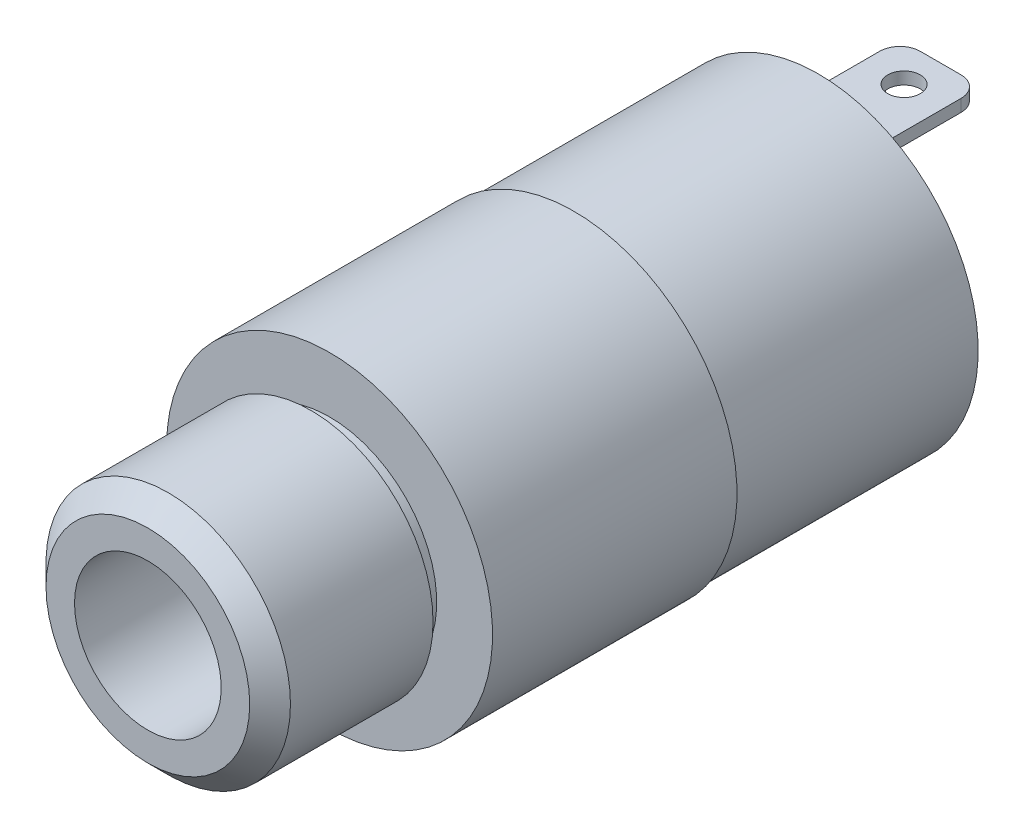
ISO-10303-21;
HEADER;
FILE_DESCRIPTION(('STEP AP214'),'2;1');
FILE_NAME('part.step','',(''),(''),'','','');
FILE_SCHEMA(('AUTOMOTIVE_DESIGN { 1 0 10303 214 1 1 1 1 }'));
ENDSEC;
DATA;
#1=APPLICATION_CONTEXT('core data for automotive mechanical design processes');
#2=APPLICATION_PROTOCOL_DEFINITION('international standard','automotive_design',2000,#1);
#3=PRODUCT_CONTEXT('',#1,'mechanical');
#4=PRODUCT('Part','Part','',(#3));
#5=PRODUCT_RELATED_PRODUCT_CATEGORY('part','',(#4));
#6=PRODUCT_DEFINITION_FORMATION('','',#4);
#7=PRODUCT_DEFINITION_CONTEXT('part definition',#1,'design');
#8=PRODUCT_DEFINITION('design','',#6,#7);
#9=PRODUCT_DEFINITION_SHAPE('','',#8);
#10=(LENGTH_UNIT() NAMED_UNIT(*) SI_UNIT(.MILLI.,.METRE.));
#11=(NAMED_UNIT(*) PLANE_ANGLE_UNIT() SI_UNIT($,.RADIAN.));
#12=(NAMED_UNIT(*) SI_UNIT($,.STERADIAN.) SOLID_ANGLE_UNIT());
#13=UNCERTAINTY_MEASURE_WITH_UNIT(LENGTH_MEASURE(1.E-05),#10,'distance_accuracy_value','');
#14=(GEOMETRIC_REPRESENTATION_CONTEXT(3) GLOBAL_UNCERTAINTY_ASSIGNED_CONTEXT((#13)) GLOBAL_UNIT_ASSIGNED_CONTEXT((#10,
#11,#12)) REPRESENTATION_CONTEXT('',''));
#15=CARTESIAN_POINT('',(0.,0.,0.));
#16=DIRECTION('',(0.,0.,1.));
#17=DIRECTION('',(1.,0.,0.));
#18=AXIS2_PLACEMENT_3D('',#15,#16,#17);
#19=CARTESIAN_POINT('',(0.,0.,-12.));
#20=DIRECTION('',(0.,0.,1.));
#21=DIRECTION('',(1.,0.,0.));
#22=AXIS2_PLACEMENT_3D('',#19,#20,#21);
#23=PLANE('',#22);
#24=CARTESIAN_POINT('',(0.,0.,-12.));
#25=DIRECTION('',(0.,0.,-1.));
#26=DIRECTION('',(-1.,0.,0.));
#27=AXIS2_PLACEMENT_3D('',#24,#25,#26);
#28=CIRCLE('',#27,1.775);
#29=CARTESIAN_POINT('',(-1.775,0.,-12.));
#30=VERTEX_POINT('',#29);
#31=EDGE_CURVE('E20',#30,#30,#28,.F.);
#32=ORIENTED_EDGE('',*,*,#31,.T.);
#33=EDGE_LOOP('',(#32));
#34=FACE_BOUND('',#33,.T.);
#35=ADVANCED_FACE('F17',(#34),#23,.T.);
#36=CARTESIAN_POINT('',(0.,0.,4.));
#37=DIRECTION('',(0.,0.,-1.));
#38=DIRECTION('',(-1.,0.,0.));
#39=AXIS2_PLACEMENT_3D('',#36,#37,#38);
#40=CYLINDRICAL_SURFACE('',#39,1.775);
#41=ORIENTED_EDGE('',*,*,#31,.F.);
#42=EDGE_LOOP('',(#41));
#43=FACE_BOUND('',#42,.T.);
#44=CARTESIAN_POINT('',(0.,0.,-6.46));
#45=DIRECTION('',(0.,0.,-1.));
#46=DIRECTION('',(-1.,0.,0.));
#47=AXIS2_PLACEMENT_3D('',#44,#45,#46);
#48=CIRCLE('',#47,1.775);
#49=CARTESIAN_POINT('',(-1.775,0.,-6.46));
#50=VERTEX_POINT('',#49);
#51=EDGE_CURVE('E179',#50,#50,#48,.T.);
#52=ORIENTED_EDGE('',*,*,#51,.F.);
#53=EDGE_LOOP('',(#52));
#54=FACE_BOUND('',#53,.T.);
#55=ADVANCED_FACE('F187',(#43,#54),#40,.F.);
#56=CARTESIAN_POINT('',(0.,0.,-6.46));
#57=DIRECTION('',(0.,0.,1.));
#58=DIRECTION('',(1.,0.,0.));
#59=AXIS2_PLACEMENT_3D('',#56,#57,#58);
#60=PLANE('',#59);
#61=CARTESIAN_POINT('',(0.,0.,-6.46));
#62=DIRECTION('',(0.,0.,-1.));
#63=DIRECTION('',(-1.,0.,0.));
#64=AXIS2_PLACEMENT_3D('',#61,#62,#63);
#65=CIRCLE('',#64,1.8);
#66=CARTESIAN_POINT('',(-1.8,0.,-6.46));
#67=VERTEX_POINT('',#66);
#68=EDGE_CURVE('E177',#67,#67,#65,.F.);
#69=ORIENTED_EDGE('',*,*,#68,.T.);
#70=EDGE_LOOP('',(#69));
#71=FACE_BOUND('',#70,.T.);
#72=ORIENTED_EDGE('',*,*,#51,.T.);
#73=EDGE_LOOP('',(#72));
#74=FACE_BOUND('',#73,.T.);
#75=ADVANCED_FACE('F190',(#71,#74),#60,.T.);
#76=CARTESIAN_POINT('',(0.,0.,4.));
#77=DIRECTION('',(0.,0.,-1.));
#78=DIRECTION('',(-1.,0.,0.));
#79=AXIS2_PLACEMENT_3D('',#76,#77,#78);
#80=CYLINDRICAL_SURFACE('',#79,1.8);
#81=ORIENTED_EDGE('',*,*,#68,.F.);
#82=EDGE_LOOP('',(#81));
#83=FACE_BOUND('',#82,.T.);
#84=CARTESIAN_POINT('',(0.,0.,4.));
#85=DIRECTION('',(0.,0.,-1.));
#86=DIRECTION('',(-1.,0.,0.));
#87=AXIS2_PLACEMENT_3D('',#84,#85,#86);
#88=CIRCLE('',#87,1.8);
#89=CARTESIAN_POINT('',(-1.8,0.,4.));
#90=VERTEX_POINT('',#89);
#91=EDGE_CURVE('E173',#90,#90,#88,.T.);
#92=ORIENTED_EDGE('',*,*,#91,.F.);
#93=EDGE_LOOP('',(#92));
#94=FACE_BOUND('',#93,.T.);
#95=ADVANCED_FACE('F196',(#83,#94),#80,.F.);
#96=CARTESIAN_POINT('',(0.,0.,4.));
#97=DIRECTION('',(0.,0.,1.));
#98=DIRECTION('',(1.,0.,0.));
#99=AXIS2_PLACEMENT_3D('',#96,#97,#98);
#100=PLANE('',#99);
#101=CARTESIAN_POINT('',(0.,0.,4.0000000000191));
#102=DIRECTION('',(0.,0.,-1.));
#103=DIRECTION('',(0.,1.,0.));
#104=AXIS2_PLACEMENT_3D('',#101,#102,#103);
#105=CIRCLE('',#104,2.49999999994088);
#106=CARTESIAN_POINT('',(0.,2.49999999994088,4.0000000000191));
#107=VERTEX_POINT('',#106);
#108=EDGE_CURVE('E164',#107,#107,#105,.T.);
#109=ORIENTED_EDGE('',*,*,#108,.F.);
#110=EDGE_LOOP('',(#109));
#111=FACE_BOUND('',#110,.T.);
#112=ORIENTED_EDGE('',*,*,#91,.T.);
#113=EDGE_LOOP('',(#112));
#114=FACE_BOUND('',#113,.T.);
#115=ADVANCED_FACE('F329',(#111,#114),#100,.T.);
#116=CARTESIAN_POINT('',(0.,-2.65,-14.56));
#117=DIRECTION('',(0.,1.,0.));
#118=DIRECTION('',(0.,0.,1.));
#119=AXIS2_PLACEMENT_3D('',#116,#117,#118);
#120=CYLINDRICAL_SURFACE('',#119,0.4);
#121=CARTESIAN_POINT('',(0.,-2.65,-14.56));
#122=DIRECTION('',(0.,1.,0.));
#123=DIRECTION('',(0.,0.,1.));
#124=AXIS2_PLACEMENT_3D('',#121,#122,#123);
#125=CIRCLE('',#124,0.4);
#126=CARTESIAN_POINT('',(0.,-2.65,-14.16));
#127=VERTEX_POINT('',#126);
#128=EDGE_CURVE('E757',#127,#127,#125,.T.);
#129=ORIENTED_EDGE('',*,*,#128,.F.);
#130=EDGE_LOOP('',(#129));
#131=FACE_BOUND('',#130,.T.);
#132=CARTESIAN_POINT('',(0.,-2.35,-14.56));
#133=DIRECTION('',(0.,1.,0.));
#134=DIRECTION('',(0.,0.,1.));
#135=AXIS2_PLACEMENT_3D('',#132,#133,#134);
#136=CIRCLE('',#135,0.4);
#137=CARTESIAN_POINT('',(0.,-2.35,-14.16));
#138=VERTEX_POINT('',#137);
#139=EDGE_CURVE('E880',#138,#138,#136,.F.);
#140=ORIENTED_EDGE('',*,*,#139,.F.);
#141=EDGE_LOOP('',(#140));
#142=FACE_BOUND('',#141,.T.);
#143=ADVANCED_FACE('F326',(#131,#142),#120,.F.);
#144=CARTESIAN_POINT('',(0.499999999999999,-2.425,-14.96));
#145=DIRECTION('',(0.,-1.,0.));
#146=DIRECTION('',(0.,0.,-1.));
#147=AXIS2_PLACEMENT_3D('',#144,#145,#146);
#148=CYLINDRICAL_SURFACE('',#147,0.5);
#149=CARTESIAN_POINT('',(0.499999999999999,-2.35,-14.96));
#150=DIRECTION('',(0.,-1.,0.));
#151=DIRECTION('',(0.,0.,-1.));
#152=AXIS2_PLACEMENT_3D('',#149,#150,#151);
#153=CIRCLE('',#152,0.5);
#154=CARTESIAN_POINT('',(0.999999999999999,-2.35,-14.96));
#155=VERTEX_POINT('',#154);
#156=CARTESIAN_POINT('',(0.499999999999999,-2.35,-15.46));
#157=VERTEX_POINT('',#156);
#158=EDGE_CURVE('E144',#155,#157,#153,.F.);
#159=ORIENTED_EDGE('',*,*,#158,.F.);
#160=DIRECTION('',(0.,1.,0.));
#161=VECTOR('',#160,1.);
#162=CARTESIAN_POINT('',(0.999999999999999,-2.35,-14.96));
#163=LINE('',#162,#161);
#164=CARTESIAN_POINT('',(0.999999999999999,-2.65,-14.96));
#165=VERTEX_POINT('',#164);
#166=EDGE_CURVE('E140',#165,#155,#163,.T.);
#167=ORIENTED_EDGE('',*,*,#166,.F.);
#168=CARTESIAN_POINT('',(0.499999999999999,-2.65,-14.96));
#169=DIRECTION('',(0.,-1.,0.));
#170=DIRECTION('',(0.,0.,-1.));
#171=AXIS2_PLACEMENT_3D('',#168,#169,#170);
#172=CIRCLE('',#171,0.5);
#173=CARTESIAN_POINT('',(0.499999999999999,-2.65,-15.46));
#174=VERTEX_POINT('',#173);
#175=EDGE_CURVE('E137',#174,#165,#172,.T.);
#176=ORIENTED_EDGE('',*,*,#175,.F.);
#177=DIRECTION('',(0.,1.,0.));
#178=VECTOR('',#177,1.);
#179=CARTESIAN_POINT('',(0.499999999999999,-2.5,-15.46));
#180=LINE('',#179,#178);
#181=EDGE_CURVE('E176',#174,#157,#180,.T.);
#182=ORIENTED_EDGE('',*,*,#181,.T.);
#183=EDGE_LOOP('',(#159,#167,#176,#182));
#184=FACE_BOUND('',#183,.T.);
#185=ADVANCED_FACE('F142',(#184),#148,.T.);
#186=CARTESIAN_POINT('',(0.,-2.5,-15.46));
#187=DIRECTION('',(0.,0.,1.));
#188=DIRECTION('',(1.,0.,0.));
#189=AXIS2_PLACEMENT_3D('',#186,#187,#188);
#190=PLANE('',#189);
#191=DIRECTION('',(1.,0.,0.));
#192=VECTOR('',#191,1.);
#193=CARTESIAN_POINT('',(0.999999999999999,-2.65,-15.46));
#194=LINE('',#193,#192);
#195=CARTESIAN_POINT('',(-0.500000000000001,-2.65,-15.46));
#196=VERTEX_POINT('',#195);
#197=EDGE_CURVE('E163',#196,#174,#194,.T.);
#198=ORIENTED_EDGE('',*,*,#197,.F.);
#199=DIRECTION('',(0.,1.,0.));
#200=VECTOR('',#199,1.);
#201=CARTESIAN_POINT('',(-0.500000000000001,-2.575,-15.46));
#202=LINE('',#201,#200);
#203=CARTESIAN_POINT('',(-0.500000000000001,-2.35,-15.46));
#204=VERTEX_POINT('',#203);
#205=EDGE_CURVE('E827',#204,#196,#202,.F.);
#206=ORIENTED_EDGE('',*,*,#205,.F.);
#207=DIRECTION('',(-1.,0.,0.));
#208=VECTOR('',#207,1.);
#209=CARTESIAN_POINT('',(-1.,-2.35,-15.46));
#210=LINE('',#209,#208);
#211=EDGE_CURVE('E753',#157,#204,#210,.T.);
#212=ORIENTED_EDGE('',*,*,#211,.F.);
#213=ORIENTED_EDGE('',*,*,#181,.F.);
#214=EDGE_LOOP('',(#198,#206,#212,#213));
#215=FACE_BOUND('',#214,.T.);
#216=ADVANCED_FACE('F319',(#215),#190,.F.);
#217=CARTESIAN_POINT('',(-0.500000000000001,-2.575,-14.96));
#218=DIRECTION('',(0.,1.,0.));
#219=DIRECTION('',(0.,0.,1.));
#220=AXIS2_PLACEMENT_3D('',#217,#218,#219);
#221=CYLINDRICAL_SURFACE('',#220,0.5);
#222=CARTESIAN_POINT('',(-0.500000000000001,-2.65,-14.96));
#223=DIRECTION('',(0.,1.,0.));
#224=DIRECTION('',(0.,0.,1.));
#225=AXIS2_PLACEMENT_3D('',#222,#223,#224);
#226=CIRCLE('',#225,0.5);
#227=CARTESIAN_POINT('',(-1.,-2.65,-14.96));
#228=VERTEX_POINT('',#227);
#229=EDGE_CURVE('E170',#228,#196,#226,.F.);
#230=ORIENTED_EDGE('',*,*,#229,.F.);
#231=DIRECTION('',(0.,1.,0.));
#232=VECTOR('',#231,1.);
#233=CARTESIAN_POINT('',(-1.,-2.65,-14.96));
#234=LINE('',#233,#232);
#235=CARTESIAN_POINT('',(-1.,-2.35,-14.96));
#236=VERTEX_POINT('',#235);
#237=EDGE_CURVE('E825',#236,#228,#234,.F.);
#238=ORIENTED_EDGE('',*,*,#237,.F.);
#239=CARTESIAN_POINT('',(-0.500000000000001,-2.35,-14.96));
#240=DIRECTION('',(0.,1.,0.));
#241=DIRECTION('',(0.,0.,1.));
#242=AXIS2_PLACEMENT_3D('',#239,#240,#241);
#243=CIRCLE('',#242,0.5);
#244=EDGE_CURVE('E750',#204,#236,#243,.T.);
#245=ORIENTED_EDGE('',*,*,#244,.F.);
#246=ORIENTED_EDGE('',*,*,#205,.T.);
#247=EDGE_LOOP('',(#230,#238,#245,#246));
#248=FACE_BOUND('',#247,.T.);
#249=ADVANCED_FACE('F315',(#248),#221,.T.);
#250=CARTESIAN_POINT('',(-1.,-2.65,-12.46));
#251=DIRECTION('',(-1.,0.,0.));
#252=DIRECTION('',(0.,0.,1.));
#253=AXIS2_PLACEMENT_3D('',#250,#251,#252);
#254=PLANE('',#253);
#255=DIRECTION('',(0.,1.,0.));
#256=VECTOR('',#255,1.);
#257=CARTESIAN_POINT('',(-1.,-2.65,-12.46));
#258=LINE('',#257,#256);
#259=CARTESIAN_POINT('',(-1.,-2.65,-12.46));
#260=VERTEX_POINT('',#259);
#261=CARTESIAN_POINT('',(-1.,-2.35,-12.46));
#262=VERTEX_POINT('',#261);
#263=EDGE_CURVE('E149',#260,#262,#258,.T.);
#264=ORIENTED_EDGE('',*,*,#263,.T.);
#265=DIRECTION('',(0.,0.,1.));
#266=VECTOR('',#265,1.);
#267=CARTESIAN_POINT('',(-1.,-2.35,-12.46));
#268=LINE('',#267,#266);
#269=EDGE_CURVE('E745',#236,#262,#268,.T.);
#270=ORIENTED_EDGE('',*,*,#269,.F.);
#271=ORIENTED_EDGE('',*,*,#237,.T.);
#272=DIRECTION('',(0.,0.,-1.));
#273=VECTOR('',#272,1.);
#274=CARTESIAN_POINT('',(-1.,-2.65,-12.46));
#275=LINE('',#274,#273);
#276=EDGE_CURVE('E157',#260,#228,#275,.T.);
#277=ORIENTED_EDGE('',*,*,#276,.F.);
#278=EDGE_LOOP('',(#264,#270,#271,#277));
#279=FACE_BOUND('',#278,.T.);
#280=ADVANCED_FACE('F312',(#279),#254,.T.);
#281=CARTESIAN_POINT('',(0.999999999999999,-2.35,-12.46));
#282=DIRECTION('',(1.,0.,0.));
#283=DIRECTION('',(0.,0.,-1.));
#284=AXIS2_PLACEMENT_3D('',#281,#282,#283);
#285=PLANE('',#284);
#286=DIRECTION('',(0.,1.,0.));
#287=VECTOR('',#286,1.);
#288=CARTESIAN_POINT('',(0.999999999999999,-2.35,-12.46));
#289=LINE('',#288,#287);
#290=CARTESIAN_POINT('',(0.999999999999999,-2.35,-12.46));
#291=VERTEX_POINT('',#290);
#292=CARTESIAN_POINT('',(0.999999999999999,-2.65,-12.46));
#293=VERTEX_POINT('',#292);
#294=EDGE_CURVE('E148',#291,#293,#289,.F.);
#295=ORIENTED_EDGE('',*,*,#294,.T.);
#296=DIRECTION('',(0.,0.,-1.));
#297=VECTOR('',#296,1.);
#298=CARTESIAN_POINT('',(0.999999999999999,-2.65,-12.46));
#299=LINE('',#298,#297);
#300=EDGE_CURVE('E152',#165,#293,#299,.F.);
#301=ORIENTED_EDGE('',*,*,#300,.F.);
#302=ORIENTED_EDGE('',*,*,#166,.T.);
#303=DIRECTION('',(0.,0.,1.));
#304=VECTOR('',#303,1.);
#305=CARTESIAN_POINT('',(0.999999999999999,-2.35,-12.46));
#306=LINE('',#305,#304);
#307=EDGE_CURVE('E743',#291,#155,#306,.F.);
#308=ORIENTED_EDGE('',*,*,#307,.F.);
#309=EDGE_LOOP('',(#295,#301,#302,#308));
#310=FACE_BOUND('',#309,.T.);
#311=ADVANCED_FACE('F153',(#310),#285,.T.);
#312=CARTESIAN_POINT('',(0.,-2.65,-14.56));
#313=DIRECTION('',(0.,1.,0.));
#314=DIRECTION('',(0.,0.,1.));
#315=AXIS2_PLACEMENT_3D('',#312,#313,#314);
#316=CYLINDRICAL_SURFACE('',#315,0.4);
#317=CARTESIAN_POINT('',(0.,2.35,-14.56));
#318=DIRECTION('',(0.,1.,0.));
#319=DIRECTION('',(0.,0.,1.));
#320=AXIS2_PLACEMENT_3D('',#317,#318,#319);
#321=CIRCLE('',#320,0.4);
#322=CARTESIAN_POINT('',(0.,2.35,-14.16));
#323=VERTEX_POINT('',#322);
#324=EDGE_CURVE('E868',#323,#323,#321,.T.);
#325=ORIENTED_EDGE('',*,*,#324,.F.);
#326=EDGE_LOOP('',(#325));
#327=FACE_BOUND('',#326,.T.);
#328=CARTESIAN_POINT('',(0.,2.65,-14.56));
#329=DIRECTION('',(0.,1.,0.));
#330=DIRECTION('',(0.,0.,1.));
#331=AXIS2_PLACEMENT_3D('',#328,#329,#330);
#332=CIRCLE('',#331,0.4);
#333=CARTESIAN_POINT('',(0.,2.65,-14.16));
#334=VERTEX_POINT('',#333);
#335=EDGE_CURVE('E730',#334,#334,#332,.F.);
#336=ORIENTED_EDGE('',*,*,#335,.F.);
#337=EDGE_LOOP('',(#336));
#338=FACE_BOUND('',#337,.T.);
#339=ADVANCED_FACE('F305',(#327,#338),#316,.F.);
#340=CARTESIAN_POINT('',(-0.5,2.425,-14.96));
#341=DIRECTION('',(0.,1.,0.));
#342=DIRECTION('',(0.,0.,1.));
#343=AXIS2_PLACEMENT_3D('',#340,#341,#342);
#344=CYLINDRICAL_SURFACE('',#343,0.5);
#345=CARTESIAN_POINT('',(-0.5,2.35,-14.96));
#346=DIRECTION('',(0.,1.,0.));
#347=DIRECTION('',(0.,0.,1.));
#348=AXIS2_PLACEMENT_3D('',#345,#346,#347);
#349=CIRCLE('',#348,0.5);
#350=CARTESIAN_POINT('',(-1.,2.35,-14.96));
#351=VERTEX_POINT('',#350);
#352=CARTESIAN_POINT('',(-0.5,2.35,-15.46));
#353=VERTEX_POINT('',#352);
#354=EDGE_CURVE('E726',#351,#353,#349,.F.);
#355=ORIENTED_EDGE('',*,*,#354,.F.);
#356=DIRECTION('',(0.,1.,0.));
#357=VECTOR('',#356,1.);
#358=CARTESIAN_POINT('',(-1.,2.35,-14.96));
#359=LINE('',#358,#357);
#360=CARTESIAN_POINT('',(-1.,2.65,-14.96));
#361=VERTEX_POINT('',#360);
#362=EDGE_CURVE('E793',#361,#351,#359,.F.);
#363=ORIENTED_EDGE('',*,*,#362,.F.);
#364=CARTESIAN_POINT('',(-0.5,2.65,-14.96));
#365=DIRECTION('',(0.,1.,0.));
#366=DIRECTION('',(0.,0.,1.));
#367=AXIS2_PLACEMENT_3D('',#364,#365,#366);
#368=CIRCLE('',#367,0.5);
#369=CARTESIAN_POINT('',(-0.5,2.65,-15.46));
#370=VERTEX_POINT('',#369);
#371=EDGE_CURVE('E740',#370,#361,#368,.T.);
#372=ORIENTED_EDGE('',*,*,#371,.F.);
#373=DIRECTION('',(0.,1.,0.));
#374=VECTOR('',#373,1.);
#375=CARTESIAN_POINT('',(-0.5,2.5,-15.46));
#376=LINE('',#375,#374);
#377=EDGE_CURVE('E812',#370,#353,#376,.F.);
#378=ORIENTED_EDGE('',*,*,#377,.T.);
#379=EDGE_LOOP('',(#355,#363,#372,#378));
#380=FACE_BOUND('',#379,.T.);
#381=ADVANCED_FACE('F301',(#380),#344,.T.);
#382=CARTESIAN_POINT('',(0.,2.5,-15.46));
#383=DIRECTION('',(0.,0.,1.));
#384=DIRECTION('',(1.,0.,0.));
#385=AXIS2_PLACEMENT_3D('',#382,#383,#384);
#386=PLANE('',#385);
#387=DIRECTION('',(1.,0.,0.));
#388=VECTOR('',#387,1.);
#389=CARTESIAN_POINT('',(-1.,2.65,-15.46));
#390=LINE('',#389,#388);
#391=CARTESIAN_POINT('',(0.5,2.65,-15.46));
#392=VERTEX_POINT('',#391);
#393=EDGE_CURVE('E727',#392,#370,#390,.F.);
#394=ORIENTED_EDGE('',*,*,#393,.F.);
#395=DIRECTION('',(0.,-1.,0.));
#396=VECTOR('',#395,1.);
#397=CARTESIAN_POINT('',(0.5,2.575,-15.46));
#398=LINE('',#397,#396);
#399=CARTESIAN_POINT('',(0.5,2.35,-15.46));
#400=VERTEX_POINT('',#399);
#401=EDGE_CURVE('E807',#400,#392,#398,.F.);
#402=ORIENTED_EDGE('',*,*,#401,.F.);
#403=DIRECTION('',(1.,0.,0.));
#404=VECTOR('',#403,1.);
#405=CARTESIAN_POINT('',(1.,2.35,-15.46));
#406=LINE('',#405,#404);
#407=EDGE_CURVE('E723',#353,#400,#406,.T.);
#408=ORIENTED_EDGE('',*,*,#407,.F.);
#409=ORIENTED_EDGE('',*,*,#377,.F.);
#410=EDGE_LOOP('',(#394,#402,#408,#409));
#411=FACE_BOUND('',#410,.T.);
#412=ADVANCED_FACE('F297',(#411),#386,.F.);
#413=CARTESIAN_POINT('',(0.5,2.575,-14.96));
#414=DIRECTION('',(0.,-1.,0.));
#415=DIRECTION('',(1.,0.,0.));
#416=AXIS2_PLACEMENT_3D('',#413,#414,#415);
#417=CYLINDRICAL_SURFACE('',#416,0.5);
#418=CARTESIAN_POINT('',(0.5,2.65,-14.96));
#419=DIRECTION('',(0.,-1.,0.));
#420=DIRECTION('',(1.,0.,0.));
#421=AXIS2_PLACEMENT_3D('',#418,#419,#420);
#422=CIRCLE('',#421,0.5);
#423=CARTESIAN_POINT('',(1.,2.65,-14.96));
#424=VERTEX_POINT('',#423);
#425=EDGE_CURVE('E731',#424,#392,#422,.F.);
#426=ORIENTED_EDGE('',*,*,#425,.F.);
#427=DIRECTION('',(0.,1.,0.));
#428=VECTOR('',#427,1.);
#429=CARTESIAN_POINT('',(1.,2.65,-14.96));
#430=LINE('',#429,#428);
#431=CARTESIAN_POINT('',(1.,2.35,-14.96));
#432=VERTEX_POINT('',#431);
#433=EDGE_CURVE('E805',#432,#424,#430,.T.);
#434=ORIENTED_EDGE('',*,*,#433,.F.);
#435=CARTESIAN_POINT('',(0.5,2.35,-14.96));
#436=DIRECTION('',(0.,-1.,0.));
#437=DIRECTION('',(1.,0.,0.));
#438=AXIS2_PLACEMENT_3D('',#435,#436,#437);
#439=CIRCLE('',#438,0.5);
#440=EDGE_CURVE('E720',#400,#432,#439,.T.);
#441=ORIENTED_EDGE('',*,*,#440,.F.);
#442=ORIENTED_EDGE('',*,*,#401,.T.);
#443=EDGE_LOOP('',(#426,#434,#441,#442));
#444=FACE_BOUND('',#443,.T.);
#445=ADVANCED_FACE('F293',(#444),#417,.T.);
#446=CARTESIAN_POINT('',(1.,2.65,-12.46));
#447=DIRECTION('',(1.,0.,0.));
#448=DIRECTION('',(0.,1.,0.));
#449=AXIS2_PLACEMENT_3D('',#446,#447,#448);
#450=PLANE('',#449);
#451=DIRECTION('',(0.,1.,0.));
#452=VECTOR('',#451,1.);
#453=CARTESIAN_POINT('',(1.,2.65,-12.46));
#454=LINE('',#453,#452);
#455=CARTESIAN_POINT('',(1.,2.65,-12.46));
#456=VERTEX_POINT('',#455);
#457=CARTESIAN_POINT('',(1.,2.35,-12.46));
#458=VERTEX_POINT('',#457);
#459=EDGE_CURVE('E796',#456,#458,#454,.F.);
#460=ORIENTED_EDGE('',*,*,#459,.T.);
#461=DIRECTION('',(0.,0.,-1.));
#462=VECTOR('',#461,1.);
#463=CARTESIAN_POINT('',(1.,2.35,-12.46));
#464=LINE('',#463,#462);
#465=EDGE_CURVE('E715',#432,#458,#464,.F.);
#466=ORIENTED_EDGE('',*,*,#465,.F.);
#467=ORIENTED_EDGE('',*,*,#433,.T.);
#468=DIRECTION('',(0.,0.,1.));
#469=VECTOR('',#468,1.);
#470=CARTESIAN_POINT('',(1.,2.65,-12.46));
#471=LINE('',#470,#469);
#472=EDGE_CURVE('E732',#456,#424,#471,.F.);
#473=ORIENTED_EDGE('',*,*,#472,.F.);
#474=EDGE_LOOP('',(#460,#466,#467,#473));
#475=FACE_BOUND('',#474,.T.);
#476=ADVANCED_FACE('F289',(#475),#450,.T.);
#477=CARTESIAN_POINT('',(-1.,2.35,-12.46));
#478=DIRECTION('',(-1.,0.,0.));
#479=DIRECTION('',(0.,0.,1.));
#480=AXIS2_PLACEMENT_3D('',#477,#478,#479);
#481=PLANE('',#480);
#482=DIRECTION('',(0.,1.,0.));
#483=VECTOR('',#482,1.);
#484=CARTESIAN_POINT('',(-1.,2.35,-12.46));
#485=LINE('',#484,#483);
#486=CARTESIAN_POINT('',(-1.,2.35,-12.46));
#487=VERTEX_POINT('',#486);
#488=CARTESIAN_POINT('',(-1.,2.65,-12.46));
#489=VERTEX_POINT('',#488);
#490=EDGE_CURVE('E784',#487,#489,#485,.T.);
#491=ORIENTED_EDGE('',*,*,#490,.T.);
#492=DIRECTION('',(0.,0.,1.));
#493=VECTOR('',#492,1.);
#494=CARTESIAN_POINT('',(-1.,2.65,-12.46));
#495=LINE('',#494,#493);
#496=EDGE_CURVE('E735',#361,#489,#495,.T.);
#497=ORIENTED_EDGE('',*,*,#496,.F.);
#498=ORIENTED_EDGE('',*,*,#362,.T.);
#499=DIRECTION('',(0.,0.,-1.));
#500=VECTOR('',#499,1.);
#501=CARTESIAN_POINT('',(-1.,2.35,-12.46));
#502=LINE('',#501,#500);
#503=EDGE_CURVE('E712',#487,#351,#502,.T.);
#504=ORIENTED_EDGE('',*,*,#503,.F.);
#505=EDGE_LOOP('',(#491,#497,#498,#504));
#506=FACE_BOUND('',#505,.T.);
#507=ADVANCED_FACE('F285',(#506),#481,.T.);
#508=CARTESIAN_POINT('',(-2.65,0.,-15.21));
#509=DIRECTION('',(1.,0.,0.));
#510=DIRECTION('',(0.,1.,0.));
#511=AXIS2_PLACEMENT_3D('',#508,#509,#510);
#512=CYLINDRICAL_SURFACE('',#511,0.4);
#513=CARTESIAN_POINT('',(-2.65,0.,-15.21));
#514=DIRECTION('',(1.,0.,0.));
#515=DIRECTION('',(0.,1.,0.));
#516=AXIS2_PLACEMENT_3D('',#513,#514,#515);
#517=CIRCLE('',#516,0.4);
#518=CARTESIAN_POINT('',(-2.65,0.399999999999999,-15.21));
#519=VERTEX_POINT('',#518);
#520=EDGE_CURVE('E855',#519,#519,#517,.T.);
#521=ORIENTED_EDGE('',*,*,#520,.F.);
#522=EDGE_LOOP('',(#521));
#523=FACE_BOUND('',#522,.T.);
#524=CARTESIAN_POINT('',(-2.35,0.,-15.21));
#525=DIRECTION('',(1.,0.,0.));
#526=DIRECTION('',(0.,1.,0.));
#527=AXIS2_PLACEMENT_3D('',#524,#525,#526);
#528=CIRCLE('',#527,0.4);
#529=CARTESIAN_POINT('',(-2.35,0.399999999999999,-15.21));
#530=VERTEX_POINT('',#529);
#531=EDGE_CURVE('E699',#530,#530,#528,.F.);
#532=ORIENTED_EDGE('',*,*,#531,.F.);
#533=EDGE_LOOP('',(#532));
#534=FACE_BOUND('',#533,.T.);
#535=ADVANCED_FACE('F281',(#523,#534),#512,.F.);
#536=CARTESIAN_POINT('',(-2.425,-0.500000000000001,-15.96));
#537=DIRECTION('',(-1.,0.,0.));
#538=DIRECTION('',(0.,0.,1.));
#539=AXIS2_PLACEMENT_3D('',#536,#537,#538);
#540=CYLINDRICAL_SURFACE('',#539,0.5);
#541=CARTESIAN_POINT('',(-2.35,-0.500000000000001,-15.96));
#542=DIRECTION('',(-1.,0.,0.));
#543=DIRECTION('',(0.,0.,1.));
#544=AXIS2_PLACEMENT_3D('',#541,#542,#543);
#545=CIRCLE('',#544,0.5);
#546=CARTESIAN_POINT('',(-2.35,-1.,-15.96));
#547=VERTEX_POINT('',#546);
#548=CARTESIAN_POINT('',(-2.35,-0.500000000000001,-16.46));
#549=VERTEX_POINT('',#548);
#550=EDGE_CURVE('E711',#547,#549,#545,.F.);
#551=ORIENTED_EDGE('',*,*,#550,.F.);
#552=DIRECTION('',(1.,0.,0.));
#553=VECTOR('',#552,1.);
#554=CARTESIAN_POINT('',(-2.35,-1.,-15.96));
#555=LINE('',#554,#553);
#556=CARTESIAN_POINT('',(-2.65,-1.,-15.96));
#557=VERTEX_POINT('',#556);
#558=EDGE_CURVE('E781',#557,#547,#555,.T.);
#559=ORIENTED_EDGE('',*,*,#558,.F.);
#560=CARTESIAN_POINT('',(-2.65,-0.500000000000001,-15.96));
#561=DIRECTION('',(-1.,0.,0.));
#562=DIRECTION('',(0.,0.,1.));
#563=AXIS2_PLACEMENT_3D('',#560,#561,#562);
#564=CIRCLE('',#563,0.5);
#565=CARTESIAN_POINT('',(-2.65,-0.500000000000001,-16.46));
#566=VERTEX_POINT('',#565);
#567=EDGE_CURVE('E693',#566,#557,#564,.T.);
#568=ORIENTED_EDGE('',*,*,#567,.F.);
#569=DIRECTION('',(1.,0.,0.));
#570=VECTOR('',#569,1.);
#571=CARTESIAN_POINT('',(-2.5,-0.500000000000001,-16.46));
#572=LINE('',#571,#570);
#573=EDGE_CURVE('E167',#566,#549,#572,.T.);
#574=ORIENTED_EDGE('',*,*,#573,.T.);
#575=EDGE_LOOP('',(#551,#559,#568,#574));
#576=FACE_BOUND('',#575,.T.);
#577=ADVANCED_FACE('F278',(#576),#540,.T.);
#578=CARTESIAN_POINT('',(-2.35,-1.,-12.46));
#579=DIRECTION('',(0.,-1.,0.));
#580=DIRECTION('',(0.,0.,-1.));
#581=AXIS2_PLACEMENT_3D('',#578,#579,#580);
#582=PLANE('',#581);
#583=DIRECTION('',(1.,0.,0.));
#584=VECTOR('',#583,1.);
#585=CARTESIAN_POINT('',(-2.35,-1.,-12.46));
#586=LINE('',#585,#584);
#587=CARTESIAN_POINT('',(-2.35,-1.,-12.46));
#588=VERTEX_POINT('',#587);
#589=CARTESIAN_POINT('',(-2.65,-1.,-12.46));
#590=VERTEX_POINT('',#589);
#591=EDGE_CURVE('E35',#588,#590,#586,.F.);
#592=ORIENTED_EDGE('',*,*,#591,.T.);
#593=DIRECTION('',(0.,0.,1.));
#594=VECTOR('',#593,1.);
#595=CARTESIAN_POINT('',(-2.65,-1.,-12.46));
#596=LINE('',#595,#594);
#597=EDGE_CURVE('E689',#557,#590,#596,.T.);
#598=ORIENTED_EDGE('',*,*,#597,.F.);
#599=ORIENTED_EDGE('',*,*,#558,.T.);
#600=DIRECTION('',(0.,0.,1.));
#601=VECTOR('',#600,1.);
#602=CARTESIAN_POINT('',(-2.35,-1.,-12.46));
#603=LINE('',#602,#601);
#604=EDGE_CURVE('E696',#588,#547,#603,.F.);
#605=ORIENTED_EDGE('',*,*,#604,.F.);
#606=EDGE_LOOP('',(#592,#598,#599,#605));
#607=FACE_BOUND('',#606,.T.);
#608=ADVANCED_FACE('F274',(#607),#582,.T.);
#609=CARTESIAN_POINT('',(-2.65,0.999999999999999,-12.46));
#610=DIRECTION('',(0.,1.,0.));
#611=DIRECTION('',(0.,0.,1.));
#612=AXIS2_PLACEMENT_3D('',#609,#610,#611);
#613=PLANE('',#612);
#614=DIRECTION('',(1.,0.,0.));
#615=VECTOR('',#614,1.);
#616=CARTESIAN_POINT('',(-2.65,0.999999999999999,-12.46));
#617=LINE('',#616,#615);
#618=CARTESIAN_POINT('',(-2.65,0.999999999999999,-12.46));
#619=VERTEX_POINT('',#618);
#620=CARTESIAN_POINT('',(-2.35,0.999999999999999,-12.46));
#621=VERTEX_POINT('',#620);
#622=EDGE_CURVE('E769',#619,#621,#617,.T.);
#623=ORIENTED_EDGE('',*,*,#622,.T.);
#624=DIRECTION('',(0.,0.,1.));
#625=VECTOR('',#624,1.);
#626=CARTESIAN_POINT('',(-2.35,0.999999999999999,-12.46));
#627=LINE('',#626,#625);
#628=CARTESIAN_POINT('',(-2.35,0.999999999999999,-15.96));
#629=VERTEX_POINT('',#628);
#630=EDGE_CURVE('E700',#629,#621,#627,.T.);
#631=ORIENTED_EDGE('',*,*,#630,.F.);
#632=DIRECTION('',(1.,0.,0.));
#633=VECTOR('',#632,1.);
#634=CARTESIAN_POINT('',(-2.575,0.999999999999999,-15.96));
#635=LINE('',#634,#633);
#636=CARTESIAN_POINT('',(-2.65,0.999999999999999,-15.96));
#637=VERTEX_POINT('',#636);
#638=EDGE_CURVE('E766',#637,#629,#635,.T.);
#639=ORIENTED_EDGE('',*,*,#638,.F.);
#640=DIRECTION('',(0.,0.,1.));
#641=VECTOR('',#640,1.);
#642=CARTESIAN_POINT('',(-2.65,0.999999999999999,-12.46));
#643=LINE('',#642,#641);
#644=EDGE_CURVE('E686',#619,#637,#643,.F.);
#645=ORIENTED_EDGE('',*,*,#644,.F.);
#646=EDGE_LOOP('',(#623,#631,#639,#645));
#647=FACE_BOUND('',#646,.T.);
#648=ADVANCED_FACE('F270',(#647),#613,.T.);
#649=CARTESIAN_POINT('',(-2.575,0.499999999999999,-15.96));
#650=DIRECTION('',(1.,0.,0.));
#651=DIRECTION('',(0.,0.,-1.));
#652=AXIS2_PLACEMENT_3D('',#649,#650,#651);
#653=CYLINDRICAL_SURFACE('',#652,0.5);
#654=CARTESIAN_POINT('',(-2.65,0.499999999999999,-15.96));
#655=DIRECTION('',(1.,0.,0.));
#656=DIRECTION('',(0.,0.,-1.));
#657=AXIS2_PLACEMENT_3D('',#654,#655,#656);
#658=CIRCLE('',#657,0.5);
#659=CARTESIAN_POINT('',(-2.65,0.499999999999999,-16.46));
#660=VERTEX_POINT('',#659);
#661=EDGE_CURVE('E681',#637,#660,#658,.F.);
#662=ORIENTED_EDGE('',*,*,#661,.F.);
#663=ORIENTED_EDGE('',*,*,#638,.T.);
#664=CARTESIAN_POINT('',(-2.35,0.499999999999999,-15.96));
#665=DIRECTION('',(1.,0.,0.));
#666=DIRECTION('',(0.,0.,-1.));
#667=AXIS2_PLACEMENT_3D('',#664,#665,#666);
#668=CIRCLE('',#667,0.5);
#669=CARTESIAN_POINT('',(-2.35,0.499999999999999,-16.46));
#670=VERTEX_POINT('',#669);
#671=EDGE_CURVE('E705',#670,#629,#668,.T.);
#672=ORIENTED_EDGE('',*,*,#671,.F.);
#673=DIRECTION('',(1.,0.,0.));
#674=VECTOR('',#673,1.);
#675=CARTESIAN_POINT('',(-2.5,0.499999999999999,-16.46));
#676=LINE('',#675,#674);
#677=EDGE_CURVE('E764',#670,#660,#676,.F.);
#678=ORIENTED_EDGE('',*,*,#677,.T.);
#679=EDGE_LOOP('',(#662,#663,#672,#678));
#680=FACE_BOUND('',#679,.T.);
#681=ADVANCED_FACE('F266',(#680),#653,.T.);
#682=CARTESIAN_POINT('',(-2.5,0.,-16.46));
#683=DIRECTION('',(0.,0.,1.));
#684=DIRECTION('',(1.,0.,0.));
#685=AXIS2_PLACEMENT_3D('',#682,#683,#684);
#686=PLANE('',#685);
#687=DIRECTION('',(0.,-1.,0.));
#688=VECTOR('',#687,1.);
#689=CARTESIAN_POINT('',(-2.65,-1.,-16.46));
#690=LINE('',#689,#688);
#691=EDGE_CURVE('E676',#660,#566,#690,.T.);
#692=ORIENTED_EDGE('',*,*,#691,.F.);
#693=ORIENTED_EDGE('',*,*,#677,.F.);
#694=DIRECTION('',(0.,1.,0.));
#695=VECTOR('',#694,1.);
#696=CARTESIAN_POINT('',(-2.35,0.999999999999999,-16.46));
#697=LINE('',#696,#695);
#698=EDGE_CURVE('E708',#549,#670,#697,.T.);
#699=ORIENTED_EDGE('',*,*,#698,.F.);
#700=ORIENTED_EDGE('',*,*,#573,.F.);
#701=EDGE_LOOP('',(#692,#693,#699,#700));
#702=FACE_BOUND('',#701,.T.);
#703=ADVANCED_FACE('F262',(#702),#686,.F.);
#704=CARTESIAN_POINT('',(0.,0.,3.49999999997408));
#705=DIRECTION('',(0.,0.,-1.));
#706=DIRECTION('',(0.,1.,0.));
#707=AXIS2_PLACEMENT_3D('',#704,#705,#706);
#708=CONICAL_SURFACE('',#707,3.00000000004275,0.785398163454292);
#709=ORIENTED_EDGE('',*,*,#108,.T.);
#710=EDGE_LOOP('',(#709));
#711=FACE_BOUND('',#710,.T.);
#712=CARTESIAN_POINT('',(0.,0.,3.5));
#713=DIRECTION('',(0.,0.,1.));
#714=DIRECTION('',(1.,0.,0.));
#715=AXIS2_PLACEMENT_3D('',#712,#713,#714);
#716=CIRCLE('',#715,3.);
#717=CARTESIAN_POINT('',(3.,0.,3.5));
#718=VERTEX_POINT('',#717);
#719=EDGE_CURVE('E674',#718,#718,#716,.F.);
#720=ORIENTED_EDGE('',*,*,#719,.F.);
#721=EDGE_LOOP('',(#720));
#722=FACE_BOUND('',#721,.T.);
#723=ADVANCED_FACE('F258',(#711,#722),#708,.T.);
#724=CARTESIAN_POINT('',(0.999999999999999,-2.65,-12.46));
#725=DIRECTION('',(0.,-1.,0.));
#726=DIRECTION('',(0.,0.,-1.));
#727=AXIS2_PLACEMENT_3D('',#724,#725,#726);
#728=PLANE('',#727);
#729=ORIENTED_EDGE('',*,*,#128,.T.);
#730=EDGE_LOOP('',(#729));
#731=FACE_BOUND('',#730,.T.);
#732=ORIENTED_EDGE('',*,*,#229,.T.);
#733=ORIENTED_EDGE('',*,*,#197,.T.);
#734=ORIENTED_EDGE('',*,*,#175,.T.);
#735=ORIENTED_EDGE('',*,*,#300,.T.);
#736=DIRECTION('',(1.,0.,0.));
#737=VECTOR('',#736,1.);
#738=CARTESIAN_POINT('',(0.,-2.65,-12.46));
#739=LINE('',#738,#737);
#740=EDGE_CURVE('E675',#293,#260,#739,.F.);
#741=ORIENTED_EDGE('',*,*,#740,.T.);
#742=ORIENTED_EDGE('',*,*,#276,.T.);
#743=EDGE_LOOP('',(#732,#733,#734,#735,#741,#742));
#744=FACE_BOUND('',#743,.T.);
#745=ADVANCED_FACE('F161',(#731,#744),#728,.T.);
#746=CARTESIAN_POINT('',(-1.,-2.35,-12.46));
#747=DIRECTION('',(0.,1.,0.));
#748=DIRECTION('',(-1.,0.,0.));
#749=AXIS2_PLACEMENT_3D('',#746,#747,#748);
#750=PLANE('',#749);
#751=DIRECTION('',(1.,0.,0.));
#752=VECTOR('',#751,1.);
#753=CARTESIAN_POINT('',(0.,-2.35,-12.46));
#754=LINE('',#753,#752);
#755=EDGE_CURVE('E678',#262,#291,#754,.T.);
#756=ORIENTED_EDGE('',*,*,#755,.T.);
#757=ORIENTED_EDGE('',*,*,#307,.T.);
#758=ORIENTED_EDGE('',*,*,#158,.T.);
#759=ORIENTED_EDGE('',*,*,#211,.T.);
#760=ORIENTED_EDGE('',*,*,#244,.T.);
#761=ORIENTED_EDGE('',*,*,#269,.T.);
#762=EDGE_LOOP('',(#756,#757,#758,#759,#760,#761));
#763=FACE_BOUND('',#762,.T.);
#764=ORIENTED_EDGE('',*,*,#139,.T.);
#765=EDGE_LOOP('',(#764));
#766=FACE_BOUND('',#765,.T.);
#767=ADVANCED_FACE('F251',(#763,#766),#750,.T.);
#768=CARTESIAN_POINT('',(-1.,2.65,-12.46));
#769=DIRECTION('',(0.,1.,0.));
#770=DIRECTION('',(0.,0.,1.));
#771=AXIS2_PLACEMENT_3D('',#768,#769,#770);
#772=PLANE('',#771);
#773=ORIENTED_EDGE('',*,*,#335,.T.);
#774=EDGE_LOOP('',(#773));
#775=FACE_BOUND('',#774,.T.);
#776=ORIENTED_EDGE('',*,*,#425,.T.);
#777=ORIENTED_EDGE('',*,*,#393,.T.);
#778=ORIENTED_EDGE('',*,*,#371,.T.);
#779=ORIENTED_EDGE('',*,*,#496,.T.);
#780=DIRECTION('',(1.,0.,0.));
#781=VECTOR('',#780,1.);
#782=CARTESIAN_POINT('',(0.,2.65,-12.46));
#783=LINE('',#782,#781);
#784=EDGE_CURVE('E802',#489,#456,#783,.T.);
#785=ORIENTED_EDGE('',*,*,#784,.T.);
#786=ORIENTED_EDGE('',*,*,#472,.T.);
#787=EDGE_LOOP('',(#776,#777,#778,#779,#785,#786));
#788=FACE_BOUND('',#787,.T.);
#789=ADVANCED_FACE('F247',(#775,#788),#772,.T.);
#790=CARTESIAN_POINT('',(1.,2.35,-12.46));
#791=DIRECTION('',(0.,-1.,0.));
#792=DIRECTION('',(0.,0.,-1.));
#793=AXIS2_PLACEMENT_3D('',#790,#791,#792);
#794=PLANE('',#793);
#795=DIRECTION('',(1.,0.,0.));
#796=VECTOR('',#795,1.);
#797=CARTESIAN_POINT('',(0.,2.35,-12.46));
#798=LINE('',#797,#796);
#799=EDGE_CURVE('E790',#458,#487,#798,.F.);
#800=ORIENTED_EDGE('',*,*,#799,.T.);
#801=ORIENTED_EDGE('',*,*,#503,.T.);
#802=ORIENTED_EDGE('',*,*,#354,.T.);
#803=ORIENTED_EDGE('',*,*,#407,.T.);
#804=ORIENTED_EDGE('',*,*,#440,.T.);
#805=ORIENTED_EDGE('',*,*,#465,.T.);
#806=EDGE_LOOP('',(#800,#801,#802,#803,#804,#805));
#807=FACE_BOUND('',#806,.T.);
#808=ORIENTED_EDGE('',*,*,#324,.T.);
#809=EDGE_LOOP('',(#808));
#810=FACE_BOUND('',#809,.T.);
#811=ADVANCED_FACE('F243',(#807,#810),#794,.T.);
#812=CARTESIAN_POINT('',(-2.35,0.999999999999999,-12.46));
#813=DIRECTION('',(1.,0.,0.));
#814=DIRECTION('',(0.,1.,0.));
#815=AXIS2_PLACEMENT_3D('',#812,#813,#814);
#816=PLANE('',#815);
#817=ORIENTED_EDGE('',*,*,#531,.T.);
#818=EDGE_LOOP('',(#817));
#819=FACE_BOUND('',#818,.T.);
#820=DIRECTION('',(0.,1.,0.));
#821=VECTOR('',#820,1.);
#822=CARTESIAN_POINT('',(-2.35,0.,-12.46));
#823=LINE('',#822,#821);
#824=EDGE_CURVE('E778',#621,#588,#823,.F.);
#825=ORIENTED_EDGE('',*,*,#824,.T.);
#826=ORIENTED_EDGE('',*,*,#604,.T.);
#827=ORIENTED_EDGE('',*,*,#550,.T.);
#828=ORIENTED_EDGE('',*,*,#698,.T.);
#829=ORIENTED_EDGE('',*,*,#671,.T.);
#830=ORIENTED_EDGE('',*,*,#630,.T.);
#831=EDGE_LOOP('',(#825,#826,#827,#828,#829,#830));
#832=FACE_BOUND('',#831,.T.);
#833=ADVANCED_FACE('F239',(#819,#832),#816,.T.);
#834=CARTESIAN_POINT('',(-2.65,-1.,-12.46));
#835=DIRECTION('',(-1.,0.,0.));
#836=DIRECTION('',(0.,-1.,0.));
#837=AXIS2_PLACEMENT_3D('',#834,#835,#836);
#838=PLANE('',#837);
#839=ORIENTED_EDGE('',*,*,#661,.T.);
#840=ORIENTED_EDGE('',*,*,#691,.T.);
#841=ORIENTED_EDGE('',*,*,#567,.T.);
#842=ORIENTED_EDGE('',*,*,#597,.T.);
#843=DIRECTION('',(0.,1.,0.));
#844=VECTOR('',#843,1.);
#845=CARTESIAN_POINT('',(-2.65,0.,-12.46));
#846=LINE('',#845,#844);
#847=EDGE_CURVE('E774',#590,#619,#846,.T.);
#848=ORIENTED_EDGE('',*,*,#847,.T.);
#849=ORIENTED_EDGE('',*,*,#644,.T.);
#850=EDGE_LOOP('',(#839,#840,#841,#842,#848,#849));
#851=FACE_BOUND('',#850,.T.);
#852=ORIENTED_EDGE('',*,*,#520,.T.);
#853=EDGE_LOOP('',(#852));
#854=FACE_BOUND('',#853,.T.);
#855=ADVANCED_FACE('F235',(#851,#854),#838,.T.);
#856=CARTESIAN_POINT('',(0.,0.,0.));
#857=DIRECTION('',(0.,0.,1.));
#858=DIRECTION('',(1.,0.,0.));
#859=AXIS2_PLACEMENT_3D('',#856,#857,#858);
#860=CYLINDRICAL_SURFACE('',#859,3.);
#861=ORIENTED_EDGE('',*,*,#719,.T.);
#862=EDGE_LOOP('',(#861));
#863=FACE_BOUND('',#862,.T.);
#864=CARTESIAN_POINT('',(0.,0.,0.));
#865=DIRECTION('',(0.,0.,1.));
#866=DIRECTION('',(1.,0.,0.));
#867=AXIS2_PLACEMENT_3D('',#864,#865,#866);
#868=CIRCLE('',#867,3.);
#869=CARTESIAN_POINT('',(3.,0.,0.));
#870=VERTEX_POINT('',#869);
#871=EDGE_CURVE('E777',#870,#870,#868,.T.);
#872=ORIENTED_EDGE('',*,*,#871,.T.);
#873=EDGE_LOOP('',(#872));
#874=FACE_BOUND('',#873,.T.);
#875=ADVANCED_FACE('F231',(#863,#874),#860,.T.);
#876=CARTESIAN_POINT('',(0.,0.,-12.46));
#877=DIRECTION('',(0.,0.,1.));
#878=DIRECTION('',(1.,0.,0.));
#879=AXIS2_PLACEMENT_3D('',#876,#877,#878);
#880=PLANE('',#879);
#881=CARTESIAN_POINT('',(0.,0.,-12.46));
#882=DIRECTION('',(0.,0.,-1.));
#883=DIRECTION('',(-1.,0.,0.));
#884=AXIS2_PLACEMENT_3D('',#881,#882,#883);
#885=CIRCLE('',#884,3.92);
#886=CARTESIAN_POINT('',(-3.92,0.,-12.46));
#887=VERTEX_POINT('',#886);
#888=EDGE_CURVE('E846',#887,#887,#885,.F.);
#889=ORIENTED_EDGE('',*,*,#888,.F.);
#890=EDGE_LOOP('',(#889));
#891=FACE_BOUND('',#890,.T.);
#892=ORIENTED_EDGE('',*,*,#591,.F.);
#893=ORIENTED_EDGE('',*,*,#824,.F.);
#894=ORIENTED_EDGE('',*,*,#622,.F.);
#895=ORIENTED_EDGE('',*,*,#847,.F.);
#896=EDGE_LOOP('',(#892,#893,#894,#895));
#897=FACE_BOUND('',#896,.T.);
#898=ORIENTED_EDGE('',*,*,#799,.F.);
#899=ORIENTED_EDGE('',*,*,#459,.F.);
#900=ORIENTED_EDGE('',*,*,#784,.F.);
#901=ORIENTED_EDGE('',*,*,#490,.F.);
#902=EDGE_LOOP('',(#898,#899,#900,#901));
#903=FACE_BOUND('',#902,.T.);
#904=ORIENTED_EDGE('',*,*,#755,.F.);
#905=ORIENTED_EDGE('',*,*,#263,.F.);
#906=ORIENTED_EDGE('',*,*,#740,.F.);
#907=ORIENTED_EDGE('',*,*,#294,.F.);
#908=EDGE_LOOP('',(#904,#905,#906,#907));
#909=FACE_BOUND('',#908,.T.);
#910=ADVANCED_FACE('F227',(#891,#897,#903,#909),#880,.F.);
#911=CARTESIAN_POINT('',(0.,0.,0.));
#912=DIRECTION('',(0.,0.,1.));
#913=DIRECTION('',(1.,0.,0.));
#914=AXIS2_PLACEMENT_3D('',#911,#912,#913);
#915=PLANE('',#914);
#916=ORIENTED_EDGE('',*,*,#871,.F.);
#917=EDGE_LOOP('',(#916));
#918=FACE_BOUND('',#917,.T.);
#919=CARTESIAN_POINT('',(0.,0.,0.));
#920=DIRECTION('',(0.,0.,-1.));
#921=DIRECTION('',(-1.,0.,0.));
#922=AXIS2_PLACEMENT_3D('',#919,#920,#921);
#923=CIRCLE('',#922,2.63);
#924=CARTESIAN_POINT('',(-2.63,0.,0.));
#925=VERTEX_POINT('',#924);
#926=EDGE_CURVE('E843',#925,#925,#923,.T.);
#927=ORIENTED_EDGE('',*,*,#926,.F.);
#928=EDGE_LOOP('',(#927));
#929=FACE_BOUND('',#928,.T.);
#930=ADVANCED_FACE('F223',(#918,#929),#915,.F.);
#931=CARTESIAN_POINT('',(0.,0.,-6.46));
#932=DIRECTION('',(0.,0.,-1.));
#933=DIRECTION('',(-1.,0.,0.));
#934=AXIS2_PLACEMENT_3D('',#931,#932,#933);
#935=CYLINDRICAL_SURFACE('',#934,3.92);
#936=CARTESIAN_POINT('',(0.,0.,-6.46));
#937=DIRECTION('',(0.,0.,-1.));
#938=DIRECTION('',(-1.,0.,0.));
#939=AXIS2_PLACEMENT_3D('',#936,#937,#938);
#940=CIRCLE('',#939,3.92);
#941=CARTESIAN_POINT('',(-3.92,0.,-6.46));
#942=VERTEX_POINT('',#941);
#943=EDGE_CURVE('E840',#942,#942,#940,.T.);
#944=ORIENTED_EDGE('',*,*,#943,.T.);
#945=EDGE_LOOP('',(#944));
#946=FACE_BOUND('',#945,.T.);
#947=ORIENTED_EDGE('',*,*,#888,.T.);
#948=EDGE_LOOP('',(#947));
#949=FACE_BOUND('',#948,.T.);
#950=ADVANCED_FACE('F219',(#946,#949),#935,.T.);
#951=CARTESIAN_POINT('',(0.,0.,0.));
#952=DIRECTION('',(0.,0.,-1.));
#953=DIRECTION('',(-1.,0.,0.));
#954=AXIS2_PLACEMENT_3D('',#951,#952,#953);
#955=CYLINDRICAL_SURFACE('',#954,2.63);
#956=ORIENTED_EDGE('',*,*,#926,.T.);
#957=EDGE_LOOP('',(#956));
#958=FACE_BOUND('',#957,.T.);
#959=CARTESIAN_POINT('',(0.,0.,-0.46));
#960=DIRECTION('',(0.,0.,-1.));
#961=DIRECTION('',(-1.,0.,0.));
#962=AXIS2_PLACEMENT_3D('',#959,#960,#961);
#963=CIRCLE('',#962,2.63);
#964=CARTESIAN_POINT('',(-2.63,0.,-0.46));
#965=VERTEX_POINT('',#964);
#966=EDGE_CURVE('E837',#965,#965,#963,.T.);
#967=ORIENTED_EDGE('',*,*,#966,.F.);
#968=EDGE_LOOP('',(#967));
#969=FACE_BOUND('',#968,.T.);
#970=ADVANCED_FACE('F215',(#958,#969),#955,.T.);
#971=CARTESIAN_POINT('',(0.,0.,-6.46));
#972=DIRECTION('',(0.,0.,1.));
#973=DIRECTION('',(1.,0.,0.));
#974=AXIS2_PLACEMENT_3D('',#971,#972,#973);
#975=PLANE('',#974);
#976=CARTESIAN_POINT('',(0.,0.,-6.46));
#977=DIRECTION('',(0.,0.,-1.));
#978=DIRECTION('',(-1.,0.,0.));
#979=AXIS2_PLACEMENT_3D('',#976,#977,#978);
#980=CIRCLE('',#979,4.);
#981=CARTESIAN_POINT('',(-4.,0.,-6.46));
#982=VERTEX_POINT('',#981);
#983=EDGE_CURVE('E26',#982,#982,#980,.F.);
#984=ORIENTED_EDGE('',*,*,#983,.F.);
#985=EDGE_LOOP('',(#984));
#986=FACE_BOUND('',#985,.T.);
#987=ORIENTED_EDGE('',*,*,#943,.F.);
#988=EDGE_LOOP('',(#987));
#989=FACE_BOUND('',#988,.T.);
#990=ADVANCED_FACE('F208',(#986,#989),#975,.F.);
#991=CARTESIAN_POINT('',(0.,0.,-0.46));
#992=DIRECTION('',(0.,0.,1.));
#993=DIRECTION('',(1.,0.,0.));
#994=AXIS2_PLACEMENT_3D('',#991,#992,#993);
#995=PLANE('',#994);
#996=ORIENTED_EDGE('',*,*,#966,.T.);
#997=EDGE_LOOP('',(#996));
#998=FACE_BOUND('',#997,.T.);
#999=CARTESIAN_POINT('',(0.,0.,-0.46));
#1000=DIRECTION('',(0.,0.,-1.));
#1001=DIRECTION('',(-1.,0.,0.));
#1002=AXIS2_PLACEMENT_3D('',#999,#1000,#1001);
#1003=CIRCLE('',#1002,4.);
#1004=CARTESIAN_POINT('',(-4.,0.,-0.46));
#1005=VERTEX_POINT('',#1004);
#1006=EDGE_CURVE('E11',#1005,#1005,#1003,.T.);
#1007=ORIENTED_EDGE('',*,*,#1006,.F.);
#1008=EDGE_LOOP('',(#1007));
#1009=FACE_BOUND('',#1008,.T.);
#1010=ADVANCED_FACE('F202',(#998,#1009),#995,.T.);
#1011=CARTESIAN_POINT('',(0.,0.,-0.46));
#1012=DIRECTION('',(0.,0.,-1.));
#1013=DIRECTION('',(-1.,0.,0.));
#1014=AXIS2_PLACEMENT_3D('',#1011,#1012,#1013);
#1015=CYLINDRICAL_SURFACE('',#1014,4.);
#1016=ORIENTED_EDGE('',*,*,#1006,.T.);
#1017=EDGE_LOOP('',(#1016));
#1018=FACE_BOUND('',#1017,.T.);
#1019=ORIENTED_EDGE('',*,*,#983,.T.);
#1020=EDGE_LOOP('',(#1019));
#1021=FACE_BOUND('',#1020,.T.);
#1022=ADVANCED_FACE('F200',(#1018,#1021),#1015,.T.);
#1023=CLOSED_SHELL('',(#35,#55,#75,#95,#115,#143,#185,#216,#249,#280,#311,#339,#381,#412,#445,
#476,#507,#535,#577,#608,#648,#681,#703,#723,#745,#767,#789,#811,#833,#855,#875,#910,#930,#950,
#970,#990,#1010,#1022));
#1024=MANIFOLD_SOLID_BREP('B1',#1023);
#1025=ADVANCED_BREP_SHAPE_REPRESENTATION('',(#18,#1024),#14);
#1026=SHAPE_DEFINITION_REPRESENTATION(#9,#1025);
ENDSEC;
END-ISO-10303-21;
